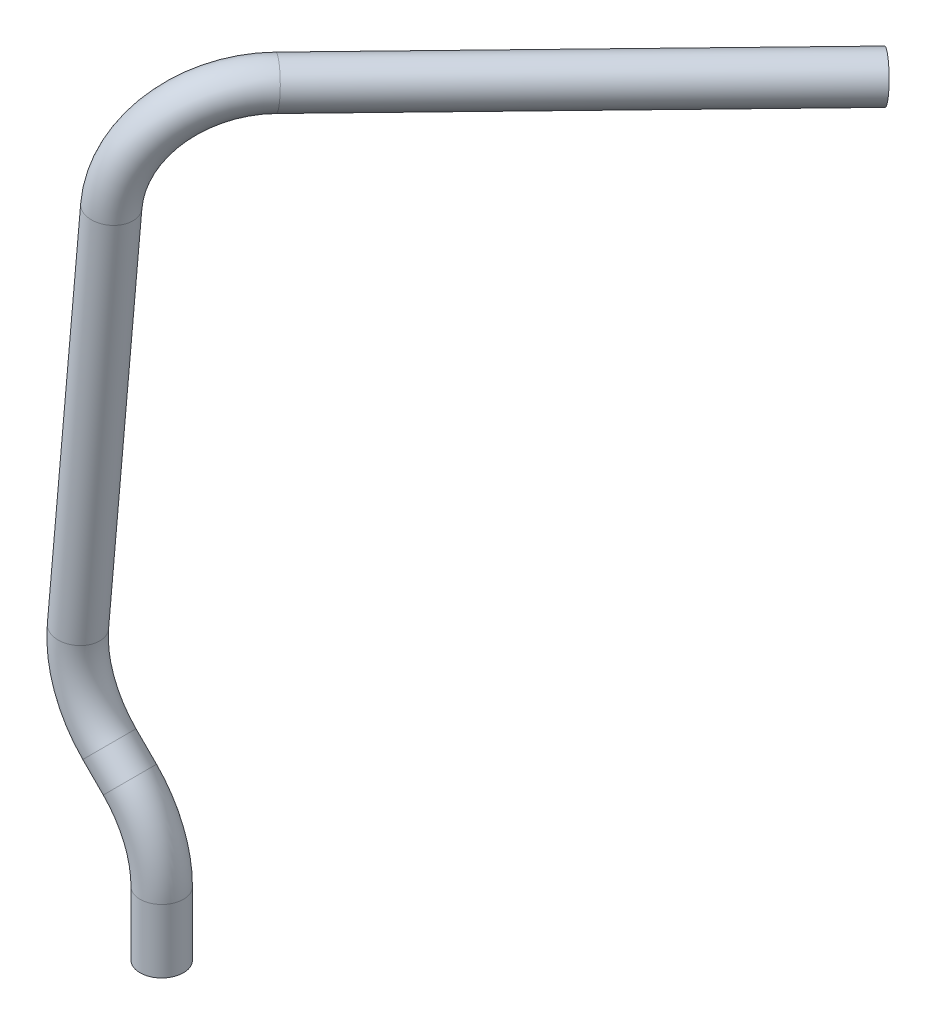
from build123d import *

# Parameters (mm, degrees)
SKETCH1_R   = 4.7625
SKETCH1_R_2 = 3.8735


with BuildPart() as part:
    # Sweep1: sweep along a curve in space
    with BuildLine() as sweep1_path:
        Line((0, 0, 0), (0, 13.949039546, 0))
        ThreePointArc((0, 13.949039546, 0), (-1.812618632, 23.061688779, 0), (-6.974519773, 30.787019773, 0))
        Line((-6.974519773, 30.787019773, 0), (-11.464647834, 35.277147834, 0))
        ThreePointArc((-11.464647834, 35.277147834, 0), (-17.003098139, 43.970773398, 0), (-18.348553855, 54.190524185, 0))
        Line((-18.348553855, 54.190524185, 0), (-11.055354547, 137.552173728, 0))
        ThreePointArc((-11.055354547, 137.552173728, 0), (-5.172148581, 154.094930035, -5.596136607), (5.992077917, 159.960109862, -19.033076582))
        Line((5.992077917, 159.960109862, -19.033076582), (64.633833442, 153.065996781, -93.773816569))
    # Sketch1 → Sweep1 (sweep)
    with BuildSketch(Plane(origin=(0, 0, 0), x_dir=(1, 0, 0), z_dir=(0, 1, 0))):
        Circle(SKETCH1_R)
        Circle(SKETCH1_R_2, mode=Mode.SUBTRACT)
    sweep(path=sweep1_path.line)


solid = part.part
